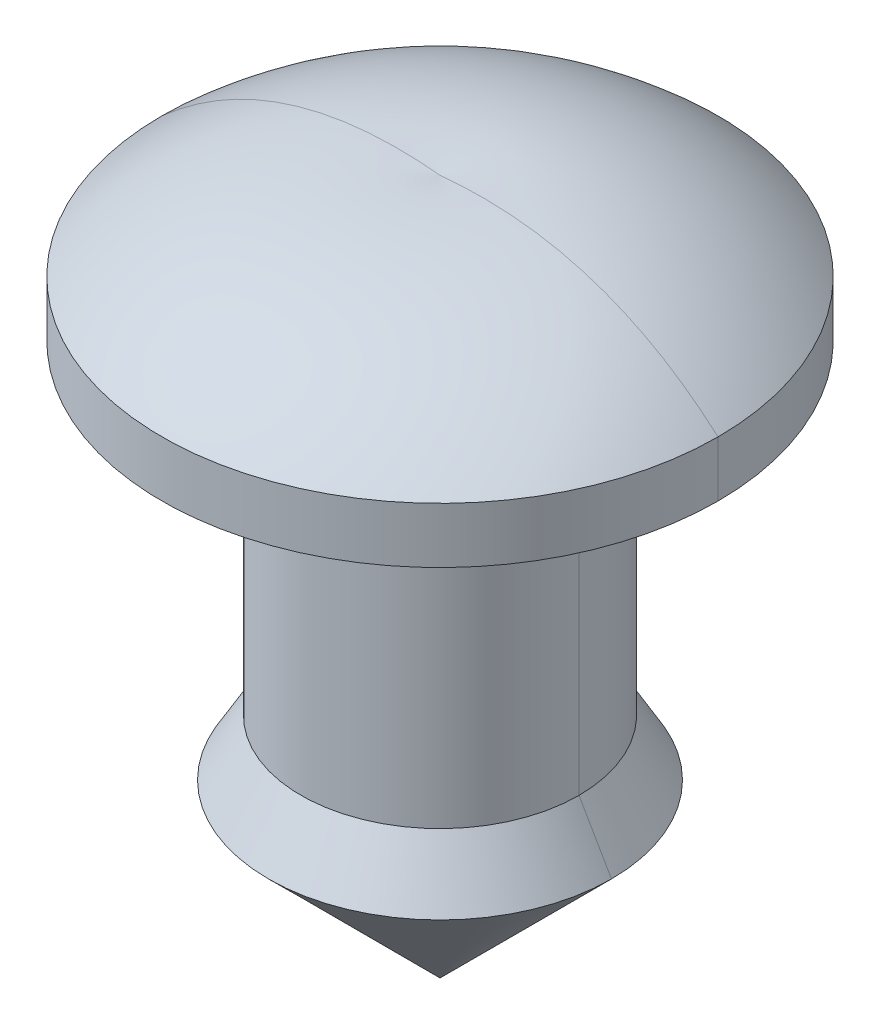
ISO-10303-21;
HEADER;
FILE_DESCRIPTION(('STEP AP214'),'2;1');
FILE_NAME('part.step','',(''),(''),'','','');
FILE_SCHEMA(('AUTOMOTIVE_DESIGN { 1 0 10303 214 1 1 1 1 }'));
ENDSEC;
DATA;
#1=APPLICATION_CONTEXT('core data for automotive mechanical design processes');
#2=APPLICATION_PROTOCOL_DEFINITION('international standard','automotive_design',2000,#1);
#3=PRODUCT_CONTEXT('',#1,'mechanical');
#4=PRODUCT('Part','Part','',(#3));
#5=PRODUCT_RELATED_PRODUCT_CATEGORY('part','',(#4));
#6=PRODUCT_DEFINITION_FORMATION('','',#4);
#7=PRODUCT_DEFINITION_CONTEXT('part definition',#1,'design');
#8=PRODUCT_DEFINITION('design','',#6,#7);
#9=PRODUCT_DEFINITION_SHAPE('','',#8);
#10=(LENGTH_UNIT() NAMED_UNIT(*) SI_UNIT(.MILLI.,.METRE.));
#11=(NAMED_UNIT(*) PLANE_ANGLE_UNIT() SI_UNIT($,.RADIAN.));
#12=(NAMED_UNIT(*) SI_UNIT($,.STERADIAN.) SOLID_ANGLE_UNIT());
#13=UNCERTAINTY_MEASURE_WITH_UNIT(LENGTH_MEASURE(1.E-05),#10,'distance_accuracy_value','');
#14=(GEOMETRIC_REPRESENTATION_CONTEXT(3) GLOBAL_UNCERTAINTY_ASSIGNED_CONTEXT((#13)) GLOBAL_UNIT_ASSIGNED_CONTEXT((#10,
#11,#12)) REPRESENTATION_CONTEXT('',''));
#15=CARTESIAN_POINT('',(0.,0.,0.));
#16=DIRECTION('',(0.,0.,1.));
#17=DIRECTION('',(1.,0.,0.));
#18=AXIS2_PLACEMENT_3D('',#15,#16,#17);
#19=CARTESIAN_POINT('',(0.,-5.612717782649,0.));
#20=DIRECTION('',(0.,1.,0.));
#21=DIRECTION('',(1.,0.,0.));
#22=AXIS2_PLACEMENT_3D('',#19,#20,#21);
#23=CONICAL_SURFACE('',#22,0.9435,0.7853981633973);
#24=CARTESIAN_POINT('',(0.,-4.706217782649,0.));
#25=DIRECTION('',(0.,-1.,0.));
#26=DIRECTION('',(1.,0.,0.));
#27=AXIS2_PLACEMENT_3D('',#24,#25,#26);
#28=CIRCLE('',#27,1.85);
#29=CARTESIAN_POINT('',(1.85,-4.706217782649,0.));
#30=VERTEX_POINT('',#29);
#31=CARTESIAN_POINT('',(-1.85,-4.706217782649,0.));
#32=VERTEX_POINT('',#31);
#33=EDGE_CURVE('E93',#30,#32,#28,.T.);
#34=ORIENTED_EDGE('',*,*,#33,.T.);
#35=DIRECTION('',(-0.707106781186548,0.707106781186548,0.));
#36=VECTOR('',#35,1.);
#37=CARTESIAN_POINT('',(0.,-6.556217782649,0.));
#38=LINE('',#37,#36);
#39=CARTESIAN_POINT('',(0.,-6.556217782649,0.));
#40=VERTEX_POINT('',#39);
#41=EDGE_CURVE('E29',#40,#32,#38,.T.);
#42=ORIENTED_EDGE('',*,*,#41,.F.);
#43=DIRECTION('',(0.707106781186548,0.707106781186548,0.));
#44=VECTOR('',#43,1.);
#45=CARTESIAN_POINT('',(0.,-6.556217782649,0.));
#46=LINE('',#45,#44);
#47=EDGE_CURVE('E11',#40,#30,#46,.T.);
#48=ORIENTED_EDGE('',*,*,#47,.T.);
#49=EDGE_LOOP('',(#34,#42,#48));
#50=FACE_BOUND('',#49,.T.);
#51=ADVANCED_FACE('F17',(#50),#23,.T.);
#52=CARTESIAN_POINT('',(0.,-5.612717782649,0.));
#53=DIRECTION('',(0.,1.,0.));
#54=DIRECTION('',(1.,0.,0.));
#55=AXIS2_PLACEMENT_3D('',#52,#53,#54);
#56=CONICAL_SURFACE('',#55,0.9435,0.7853981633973);
#57=ORIENTED_EDGE('',*,*,#41,.T.);
#58=CARTESIAN_POINT('',(0.,-4.706217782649,0.));
#59=DIRECTION('',(0.,1.,0.));
#60=DIRECTION('',(1.,0.,0.));
#61=AXIS2_PLACEMENT_3D('',#58,#59,#60);
#62=CIRCLE('',#61,1.85);
#63=EDGE_CURVE('E89',#30,#32,#62,.T.);
#64=ORIENTED_EDGE('',*,*,#63,.F.);
#65=ORIENTED_EDGE('',*,*,#47,.F.);
#66=EDGE_LOOP('',(#57,#64,#65));
#67=FACE_BOUND('',#66,.T.);
#68=ADVANCED_FACE('F190',(#67),#56,.T.);
#69=CARTESIAN_POINT('',(0.,-4.403108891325,0.));
#70=DIRECTION('',(0.,-1.,0.));
#71=DIRECTION('',(-1.,0.,0.));
#72=AXIS2_PLACEMENT_3D('',#69,#70,#71);
#73=CONICAL_SURFACE('',#72,1.675,0.5235987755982);
#74=ORIENTED_EDGE('',*,*,#63,.T.);
#75=DIRECTION('',(0.500000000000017,0.866025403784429,0.));
#76=VECTOR('',#75,1.);
#77=CARTESIAN_POINT('',(-1.85,-4.706217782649,0.));
#78=LINE('',#77,#76);
#79=CARTESIAN_POINT('',(-1.5,-4.1,0.));
#80=VERTEX_POINT('',#79);
#81=EDGE_CURVE('E83',#32,#80,#78,.T.);
#82=ORIENTED_EDGE('',*,*,#81,.T.);
#83=CARTESIAN_POINT('',(0.,-4.1,0.));
#84=DIRECTION('',(0.,1.,0.));
#85=DIRECTION('',(1.,0.,0.));
#86=AXIS2_PLACEMENT_3D('',#83,#84,#85);
#87=CIRCLE('',#86,1.5);
#88=CARTESIAN_POINT('',(1.5,-4.1,0.));
#89=VERTEX_POINT('',#88);
#90=EDGE_CURVE('E88',#89,#80,#87,.T.);
#91=ORIENTED_EDGE('',*,*,#90,.F.);
#92=DIRECTION('',(-0.500000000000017,0.866025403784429,0.));
#93=VECTOR('',#92,1.);
#94=CARTESIAN_POINT('',(1.85,-4.706217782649,0.));
#95=LINE('',#94,#93);
#96=EDGE_CURVE('E99',#30,#89,#95,.T.);
#97=ORIENTED_EDGE('',*,*,#96,.F.);
#98=EDGE_LOOP('',(#74,#82,#91,#97));
#99=FACE_BOUND('',#98,.T.);
#100=ADVANCED_FACE('F85',(#99),#73,.T.);
#101=CARTESIAN_POINT('',(0.,-4.403108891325,0.));
#102=DIRECTION('',(0.,-1.,0.));
#103=DIRECTION('',(-1.,0.,0.));
#104=AXIS2_PLACEMENT_3D('',#101,#102,#103);
#105=CONICAL_SURFACE('',#104,1.675,0.5235987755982);
#106=CARTESIAN_POINT('',(0.,-4.1,0.));
#107=DIRECTION('',(0.,-1.,0.));
#108=DIRECTION('',(1.,0.,0.));
#109=AXIS2_PLACEMENT_3D('',#106,#107,#108);
#110=CIRCLE('',#109,1.5);
#111=EDGE_CURVE('E94',#89,#80,#110,.T.);
#112=ORIENTED_EDGE('',*,*,#111,.T.);
#113=ORIENTED_EDGE('',*,*,#81,.F.);
#114=ORIENTED_EDGE('',*,*,#33,.F.);
#115=ORIENTED_EDGE('',*,*,#96,.T.);
#116=EDGE_LOOP('',(#112,#113,#114,#115));
#117=FACE_BOUND('',#116,.T.);
#118=ADVANCED_FACE('F98',(#117),#105,.T.);
#119=CARTESIAN_POINT('',(0.,-6.932395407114,0.));
#120=DIRECTION('',(0.,1.,0.));
#121=DIRECTION('',(1.,0.,0.));
#122=AXIS2_PLACEMENT_3D('',#119,#120,#121);
#123=CYLINDRICAL_SURFACE('',#122,1.5);
#124=CARTESIAN_POINT('',(0.,-0.6,0.));
#125=DIRECTION('',(0.,-1.,0.));
#126=DIRECTION('',(1.,0.,0.));
#127=AXIS2_PLACEMENT_3D('',#124,#125,#126);
#128=CIRCLE('',#127,1.5);
#129=CARTESIAN_POINT('',(1.5,-0.6,0.));
#130=VERTEX_POINT('',#129);
#131=CARTESIAN_POINT('',(-1.5,-0.6,0.));
#132=VERTEX_POINT('',#131);
#133=EDGE_CURVE('E109',#130,#132,#128,.T.);
#134=ORIENTED_EDGE('',*,*,#133,.T.);
#135=DIRECTION('',(0.,1.,0.));
#136=VECTOR('',#135,1.);
#137=CARTESIAN_POINT('',(-1.5,-4.1,0.));
#138=LINE('',#137,#136);
#139=EDGE_CURVE('E106',#80,#132,#138,.T.);
#140=ORIENTED_EDGE('',*,*,#139,.F.);
#141=ORIENTED_EDGE('',*,*,#111,.F.);
#142=DIRECTION('',(0.,1.,0.));
#143=VECTOR('',#142,1.);
#144=CARTESIAN_POINT('',(1.5,-4.1,0.));
#145=LINE('',#144,#143);
#146=EDGE_CURVE('E103',#89,#130,#145,.T.);
#147=ORIENTED_EDGE('',*,*,#146,.T.);
#148=EDGE_LOOP('',(#134,#140,#141,#147));
#149=FACE_BOUND('',#148,.T.);
#150=ADVANCED_FACE('F107',(#149),#123,.T.);
#151=CARTESIAN_POINT('',(0.,-6.932395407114,0.));
#152=DIRECTION('',(0.,1.,0.));
#153=DIRECTION('',(1.,0.,0.));
#154=AXIS2_PLACEMENT_3D('',#151,#152,#153);
#155=CYLINDRICAL_SURFACE('',#154,1.5);
#156=ORIENTED_EDGE('',*,*,#90,.T.);
#157=ORIENTED_EDGE('',*,*,#139,.T.);
#158=CARTESIAN_POINT('',(0.,-0.6,0.));
#159=DIRECTION('',(0.,1.,0.));
#160=DIRECTION('',(1.,0.,0.));
#161=AXIS2_PLACEMENT_3D('',#158,#159,#160);
#162=CIRCLE('',#161,1.5);
#163=EDGE_CURVE('E117',#130,#132,#162,.T.);
#164=ORIENTED_EDGE('',*,*,#163,.F.);
#165=ORIENTED_EDGE('',*,*,#146,.F.);
#166=EDGE_LOOP('',(#156,#157,#164,#165));
#167=FACE_BOUND('',#166,.T.);
#168=ADVANCED_FACE('F115',(#167),#155,.T.);
#169=CARTESIAN_POINT('',(0.,-0.6,0.));
#170=DIRECTION('',(0.,1.,0.));
#171=DIRECTION('',(1.,0.,0.));
#172=AXIS2_PLACEMENT_3D('',#169,#170,#171);
#173=PLANE('',#172);
#174=ORIENTED_EDGE('',*,*,#133,.F.);
#175=ORIENTED_EDGE('',*,*,#163,.T.);
#176=EDGE_LOOP('',(#174,#175));
#177=FACE_BOUND('',#176,.T.);
#178=CARTESIAN_POINT('',(0.,-0.6,0.));
#179=DIRECTION('',(0.,1.,0.));
#180=DIRECTION('',(1.,0.,0.));
#181=AXIS2_PLACEMENT_3D('',#178,#179,#180);
#182=CIRCLE('',#181,3.);
#183=CARTESIAN_POINT('',(3.,-0.6,0.));
#184=VERTEX_POINT('',#183);
#185=CARTESIAN_POINT('',(-3.,-0.6,0.));
#186=VERTEX_POINT('',#185);
#187=EDGE_CURVE('E146',#184,#186,#182,.T.);
#188=ORIENTED_EDGE('',*,*,#187,.F.);
#189=CARTESIAN_POINT('',(0.,-0.6,0.));
#190=DIRECTION('',(0.,-1.,0.));
#191=DIRECTION('',(1.,0.,0.));
#192=AXIS2_PLACEMENT_3D('',#189,#190,#191);
#193=CIRCLE('',#192,3.);
#194=EDGE_CURVE('E151',#184,#186,#193,.T.);
#195=ORIENTED_EDGE('',*,*,#194,.T.);
#196=EDGE_LOOP('',(#188,#195));
#197=FACE_BOUND('',#196,.T.);
#198=ADVANCED_FACE('F197',(#177,#197),#173,.F.);
#199=CARTESIAN_POINT('',(0.,-6.932395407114,0.));
#200=DIRECTION('',(0.,1.,0.));
#201=DIRECTION('',(1.,0.,0.));
#202=AXIS2_PLACEMENT_3D('',#199,#200,#201);
#203=CYLINDRICAL_SURFACE('',#202,3.);
#204=ORIENTED_EDGE('',*,*,#187,.T.);
#205=DIRECTION('',(0.,1.,0.));
#206=VECTOR('',#205,1.);
#207=CARTESIAN_POINT('',(-3.,-0.6,0.));
#208=LINE('',#207,#206);
#209=CARTESIAN_POINT('',(-3.,0.,0.));
#210=VERTEX_POINT('',#209);
#211=EDGE_CURVE('E155',#186,#210,#208,.T.);
#212=ORIENTED_EDGE('',*,*,#211,.T.);
#213=CARTESIAN_POINT('',(0.,0.,0.));
#214=DIRECTION('',(0.,1.,0.));
#215=DIRECTION('',(1.,0.,0.));
#216=AXIS2_PLACEMENT_3D('',#213,#214,#215);
#217=CIRCLE('',#216,3.);
#218=CARTESIAN_POINT('',(3.,0.,0.));
#219=VERTEX_POINT('',#218);
#220=EDGE_CURVE('E137',#219,#210,#217,.T.);
#221=ORIENTED_EDGE('',*,*,#220,.F.);
#222=DIRECTION('',(0.,1.,0.));
#223=VECTOR('',#222,1.);
#224=CARTESIAN_POINT('',(3.,-0.6,0.));
#225=LINE('',#224,#223);
#226=EDGE_CURVE('E149',#184,#219,#225,.T.);
#227=ORIENTED_EDGE('',*,*,#226,.F.);
#228=EDGE_LOOP('',(#204,#212,#221,#227));
#229=FACE_BOUND('',#228,.T.);
#230=ADVANCED_FACE('F188',(#229),#203,.T.);
#231=CARTESIAN_POINT('',(0.,-6.932395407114,0.));
#232=DIRECTION('',(0.,1.,0.));
#233=DIRECTION('',(1.,0.,0.));
#234=AXIS2_PLACEMENT_3D('',#231,#232,#233);
#235=CYLINDRICAL_SURFACE('',#234,3.);
#236=CARTESIAN_POINT('',(0.,0.,0.));
#237=DIRECTION('',(0.,-1.,0.));
#238=DIRECTION('',(1.,0.,0.));
#239=AXIS2_PLACEMENT_3D('',#236,#237,#238);
#240=CIRCLE('',#239,3.);
#241=EDGE_CURVE('E128',#219,#210,#240,.T.);
#242=ORIENTED_EDGE('',*,*,#241,.T.);
#243=ORIENTED_EDGE('',*,*,#211,.F.);
#244=ORIENTED_EDGE('',*,*,#194,.F.);
#245=ORIENTED_EDGE('',*,*,#226,.T.);
#246=EDGE_LOOP('',(#242,#243,#244,#245));
#247=FACE_BOUND('',#246,.T.);
#248=ADVANCED_FACE('F184',(#247),#235,.T.);
#249=CARTESIAN_POINT('',(0.,0.9437822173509,0.));
#250=CARTESIAN_POINT('',(0.7094125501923,1.014973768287,0.));
#251=CARTESIAN_POINT('',(1.77118414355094,0.867584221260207,0.));
#252=CARTESIAN_POINT('',(2.67375670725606,0.289271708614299,0.));
#253=CARTESIAN_POINT('',(3.00000000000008,0.,0.));
#254=(BOUNDED_CURVE() B_SPLINE_CURVE(3,(#249,#250,#251,#252,#253),.UNSPECIFIED.,.F.,
.F.) B_SPLINE_CURVE_WITH_KNOTS((4,1,4),(0.,0.6061462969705,0.9904592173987),
.UNSPECIFIED.) CURVE() GEOMETRIC_REPRESENTATION_ITEM() RATIONAL_B_SPLINE_CURVE((1.,1.,1.,1.,1.)) REPRESENTATION_ITEM(''));
#255=CARTESIAN_POINT('',(0.,-6.932395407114,0.));
#256=DIRECTION('',(0.,-1.,0.));
#257=AXIS1_PLACEMENT('',#255,#256);
#258=SURFACE_OF_REVOLUTION('',#254,#257);
#259=CARTESIAN_POINT('',(-3.,0.,0.));
#260=CARTESIAN_POINT('',(-2.673756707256,0.2892717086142,0.));
#261=CARTESIAN_POINT('',(-1.771184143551,0.8675842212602,0.));
#262=CARTESIAN_POINT('',(-0.7094125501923,1.014973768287,0.));
#263=CARTESIAN_POINT('',(0.,0.9437822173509,0.));
#264=(BOUNDED_CURVE() B_SPLINE_CURVE(3,(#259,#260,#261,#262,#263),.UNSPECIFIED.,.F.,
.F.) B_SPLINE_CURVE_WITH_KNOTS((4,1,4),(0.,0.3880148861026,1.),
.UNSPECIFIED.) CURVE() GEOMETRIC_REPRESENTATION_ITEM() RATIONAL_B_SPLINE_CURVE((1.,1.,1.,1.,1.)) REPRESENTATION_ITEM(''));
#265=CARTESIAN_POINT('',(0.,0.9437822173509,0.));
#266=VERTEX_POINT('',#265);
#267=EDGE_CURVE('E129',#210,#266,#264,.T.);
#268=ORIENTED_EDGE('',*,*,#267,.F.);
#269=ORIENTED_EDGE('',*,*,#241,.F.);
#270=CARTESIAN_POINT('',(3.,0.,0.));
#271=CARTESIAN_POINT('',(2.673756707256,0.2892717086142,0.));
#272=CARTESIAN_POINT('',(1.771184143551,0.8675842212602,0.));
#273=CARTESIAN_POINT('',(0.7094125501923,1.014973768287,0.));
#274=CARTESIAN_POINT('',(0.,0.9437822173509,0.));
#275=(BOUNDED_CURVE() B_SPLINE_CURVE(3,(#270,#271,#272,#273,#274),.UNSPECIFIED.,.F.,
.F.) B_SPLINE_CURVE_WITH_KNOTS((4,1,4),(0.,0.3880148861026,1.),
.UNSPECIFIED.) CURVE() GEOMETRIC_REPRESENTATION_ITEM() RATIONAL_B_SPLINE_CURVE((1.,1.,1.,1.,1.)) REPRESENTATION_ITEM(''));
#276=EDGE_CURVE('E123',#219,#266,#275,.T.);
#277=ORIENTED_EDGE('',*,*,#276,.T.);
#278=EDGE_LOOP('',(#268,#269,#277));
#279=FACE_BOUND('',#278,.T.);
#280=ADVANCED_FACE('F181',(#279),#258,.T.);
#281=CARTESIAN_POINT('',(0.,0.9437822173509,0.));
#282=CARTESIAN_POINT('',(0.7094125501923,1.014973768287,0.));
#283=CARTESIAN_POINT('',(1.77118414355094,0.867584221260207,0.));
#284=CARTESIAN_POINT('',(2.67375670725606,0.289271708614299,0.));
#285=CARTESIAN_POINT('',(3.00000000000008,0.,0.));
#286=(BOUNDED_CURVE() B_SPLINE_CURVE(3,(#281,#282,#283,#284,#285),.UNSPECIFIED.,.F.,
.F.) B_SPLINE_CURVE_WITH_KNOTS((4,1,4),(0.,0.6061462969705,0.9904592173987),
.UNSPECIFIED.) CURVE() GEOMETRIC_REPRESENTATION_ITEM() RATIONAL_B_SPLINE_CURVE((1.,1.,1.,1.,1.)) REPRESENTATION_ITEM(''));
#287=CARTESIAN_POINT('',(0.,-6.932395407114,0.));
#288=DIRECTION('',(0.,-1.,0.));
#289=AXIS1_PLACEMENT('',#287,#288);
#290=SURFACE_OF_REVOLUTION('',#286,#289);
#291=ORIENTED_EDGE('',*,*,#220,.T.);
#292=ORIENTED_EDGE('',*,*,#267,.T.);
#293=ORIENTED_EDGE('',*,*,#276,.F.);
#294=EDGE_LOOP('',(#291,#292,#293));
#295=FACE_BOUND('',#294,.T.);
#296=ADVANCED_FACE('F19',(#295),#290,.T.);
#297=CLOSED_SHELL('',(#51,#68,#100,#118,#150,#168,#198,#230,#248,#280,#296));
#298=MANIFOLD_SOLID_BREP('B1',#297);
#299=ADVANCED_BREP_SHAPE_REPRESENTATION('',(#18,#298),#14);
#300=SHAPE_DEFINITION_REPRESENTATION(#9,#299);
ENDSEC;
END-ISO-10303-21;
